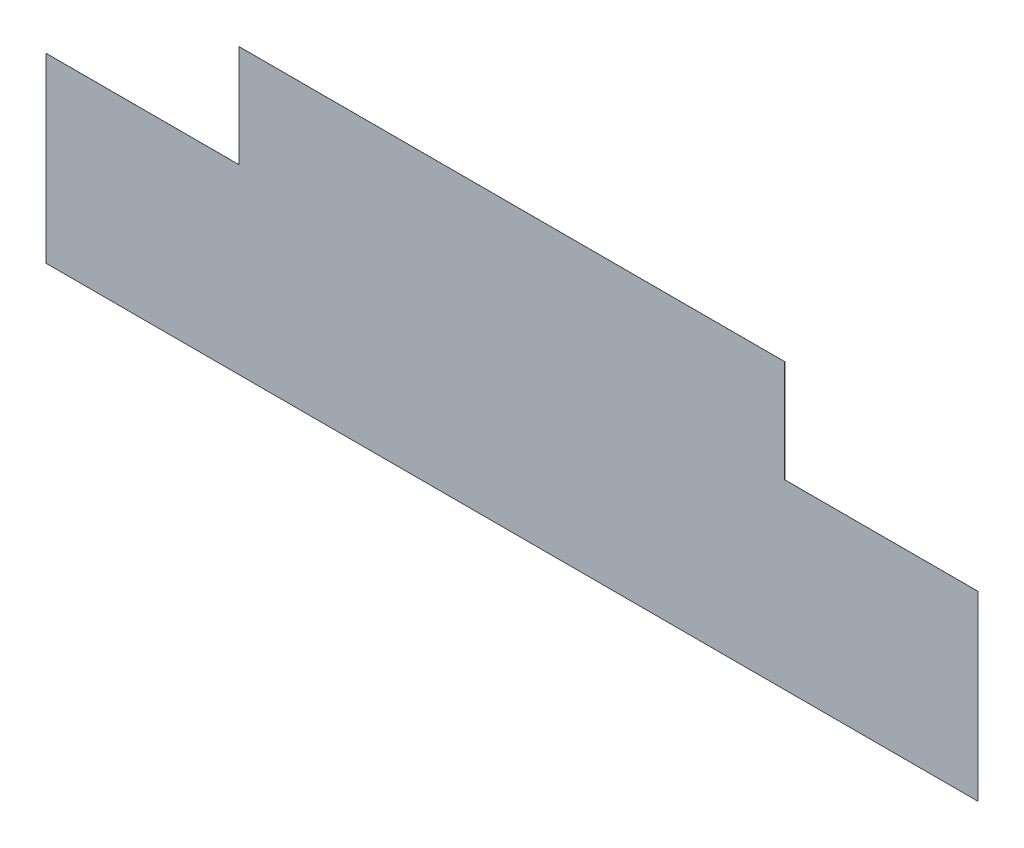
ISO-10303-21;
HEADER;
FILE_DESCRIPTION(('STEP AP214'),'2;1');
FILE_NAME('part.step','',(''),(''),'','','');
FILE_SCHEMA(('AUTOMOTIVE_DESIGN { 1 0 10303 214 1 1 1 1 }'));
ENDSEC;
DATA;
#1=APPLICATION_CONTEXT('core data for automotive mechanical design processes');
#2=APPLICATION_PROTOCOL_DEFINITION('international standard','automotive_design',2000,#1);
#3=PRODUCT_CONTEXT('',#1,'mechanical');
#4=PRODUCT('Part','Part','',(#3));
#5=PRODUCT_RELATED_PRODUCT_CATEGORY('part','',(#4));
#6=PRODUCT_DEFINITION_FORMATION('','',#4);
#7=PRODUCT_DEFINITION_CONTEXT('part definition',#1,'design');
#8=PRODUCT_DEFINITION('design','',#6,#7);
#9=PRODUCT_DEFINITION_SHAPE('','',#8);
#10=(LENGTH_UNIT() NAMED_UNIT(*) SI_UNIT(.MILLI.,.METRE.));
#11=(NAMED_UNIT(*) PLANE_ANGLE_UNIT() SI_UNIT($,.RADIAN.));
#12=(NAMED_UNIT(*) SI_UNIT($,.STERADIAN.) SOLID_ANGLE_UNIT());
#13=UNCERTAINTY_MEASURE_WITH_UNIT(LENGTH_MEASURE(1.E-05),#10,'distance_accuracy_value','');
#14=(GEOMETRIC_REPRESENTATION_CONTEXT(3) GLOBAL_UNCERTAINTY_ASSIGNED_CONTEXT((#13)) GLOBAL_UNIT_ASSIGNED_CONTEXT((#10,
#11,#12)) REPRESENTATION_CONTEXT('',''));
#15=CARTESIAN_POINT('',(0.,0.,0.));
#16=DIRECTION('',(0.,0.,1.));
#17=DIRECTION('',(1.,0.,0.));
#18=AXIS2_PLACEMENT_3D('',#15,#16,#17);
#19=CARTESIAN_POINT('',(0.,0.,0.));
#20=DIRECTION('',(0.,0.,-1.));
#21=DIRECTION('',(0.,-1.,0.));
#22=AXIS2_PLACEMENT_3D('',#19,#20,#21);
#23=PLANE('',#22);
#24=DIRECTION('',(0.,1.,0.));
#25=VECTOR('',#24,1.);
#26=CARTESIAN_POINT('',(-1.2,0.826149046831,0.));
#27=LINE('',#26,#25);
#28=CARTESIAN_POINT('',(-1.2,0.376149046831,0.));
#29=VERTEX_POINT('',#28);
#30=CARTESIAN_POINT('',(-1.2,0.826149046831,0.));
#31=VERTEX_POINT('',#30);
#32=EDGE_CURVE('E117',#29,#31,#27,.T.);
#33=ORIENTED_EDGE('',*,*,#32,.T.);
#34=DIRECTION('',(1.,0.,0.));
#35=VECTOR('',#34,1.);
#36=CARTESIAN_POINT('',(-1.2,0.826149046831,0.));
#37=LINE('',#36,#35);
#38=CARTESIAN_POINT('',(1.2,0.826149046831,0.));
#39=VERTEX_POINT('',#38);
#40=EDGE_CURVE('E130',#31,#39,#37,.T.);
#41=ORIENTED_EDGE('',*,*,#40,.T.);
#42=DIRECTION('',(0.,-1.,0.));
#43=VECTOR('',#42,1.);
#44=CARTESIAN_POINT('',(1.2,0.826149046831,0.));
#45=LINE('',#44,#43);
#46=CARTESIAN_POINT('',(1.2,0.376149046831,0.));
#47=VERTEX_POINT('',#46);
#48=EDGE_CURVE('E198',#39,#47,#45,.T.);
#49=ORIENTED_EDGE('',*,*,#48,.T.);
#50=DIRECTION('',(1.,0.,0.));
#51=VECTOR('',#50,1.);
#52=CARTESIAN_POINT('',(1.2,0.376149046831,0.));
#53=LINE('',#52,#51);
#54=CARTESIAN_POINT('',(2.05,0.376149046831,0.));
#55=VERTEX_POINT('',#54);
#56=EDGE_CURVE('E193',#47,#55,#53,.T.);
#57=ORIENTED_EDGE('',*,*,#56,.T.);
#58=DIRECTION('',(0.,-1.,0.));
#59=VECTOR('',#58,1.);
#60=CARTESIAN_POINT('',(2.05,0.376149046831,0.));
#61=LINE('',#60,#59);
#62=CARTESIAN_POINT('',(2.05,-0.423850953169,0.));
#63=VERTEX_POINT('',#62);
#64=EDGE_CURVE('E175',#55,#63,#61,.T.);
#65=ORIENTED_EDGE('',*,*,#64,.T.);
#66=DIRECTION('',(-1.,0.,0.));
#67=VECTOR('',#66,1.);
#68=CARTESIAN_POINT('',(2.05,-0.423850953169,0.));
#69=LINE('',#68,#67);
#70=CARTESIAN_POINT('',(-2.05,-0.423850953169,0.));
#71=VERTEX_POINT('',#70);
#72=EDGE_CURVE('E134',#63,#71,#69,.T.);
#73=ORIENTED_EDGE('',*,*,#72,.T.);
#74=DIRECTION('',(0.,1.,0.));
#75=VECTOR('',#74,1.);
#76=CARTESIAN_POINT('',(-2.05,-0.423850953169,0.));
#77=LINE('',#76,#75);
#78=CARTESIAN_POINT('',(-2.05,0.376149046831,0.));
#79=VERTEX_POINT('',#78);
#80=EDGE_CURVE('E146',#71,#79,#77,.T.);
#81=ORIENTED_EDGE('',*,*,#80,.T.);
#82=DIRECTION('',(1.,0.,0.));
#83=VECTOR('',#82,1.);
#84=CARTESIAN_POINT('',(-1.2,0.376149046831,0.));
#85=LINE('',#84,#83);
#86=EDGE_CURVE('E25',#79,#29,#85,.T.);
#87=ORIENTED_EDGE('',*,*,#86,.T.);
#88=EDGE_LOOP('',(#33,#41,#49,#57,#65,#73,#81,#87));
#89=FACE_BOUND('',#88,.T.);
#90=ADVANCED_FACE('F17',(#89),#23,.T.);
#91=CARTESIAN_POINT('',(0.,0.,0.0002));
#92=DIRECTION('',(0.,0.,-1.));
#93=DIRECTION('',(0.,-1.,0.));
#94=AXIS2_PLACEMENT_3D('',#91,#92,#93);
#95=PLANE('',#94);
#96=DIRECTION('',(0.,1.,0.));
#97=VECTOR('',#96,1.);
#98=CARTESIAN_POINT('',(-1.2,0.826149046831,0.0002));
#99=LINE('',#98,#97);
#100=CARTESIAN_POINT('',(-1.2,0.376149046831,0.0002));
#101=VERTEX_POINT('',#100);
#102=CARTESIAN_POINT('',(-1.2,0.826149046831,0.0002));
#103=VERTEX_POINT('',#102);
#104=EDGE_CURVE('E105',#101,#103,#99,.T.);
#105=ORIENTED_EDGE('',*,*,#104,.F.);
#106=DIRECTION('',(1.,0.,0.));
#107=VECTOR('',#106,1.);
#108=CARTESIAN_POINT('',(-1.2,0.376149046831,0.0002));
#109=LINE('',#108,#107);
#110=CARTESIAN_POINT('',(-2.05,0.376149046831,0.0002));
#111=VERTEX_POINT('',#110);
#112=EDGE_CURVE('E11',#111,#101,#109,.T.);
#113=ORIENTED_EDGE('',*,*,#112,.F.);
#114=DIRECTION('',(0.,1.,0.));
#115=VECTOR('',#114,1.);
#116=CARTESIAN_POINT('',(-2.05,-0.423850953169,0.0002));
#117=LINE('',#116,#115);
#118=CARTESIAN_POINT('',(-2.05,-0.423850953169,0.0002));
#119=VERTEX_POINT('',#118);
#120=EDGE_CURVE('E150',#119,#111,#117,.T.);
#121=ORIENTED_EDGE('',*,*,#120,.F.);
#122=DIRECTION('',(-1.,0.,0.));
#123=VECTOR('',#122,1.);
#124=CARTESIAN_POINT('',(2.05,-0.423850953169,0.0002));
#125=LINE('',#124,#123);
#126=CARTESIAN_POINT('',(2.05,-0.423850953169,0.0002));
#127=VERTEX_POINT('',#126);
#128=EDGE_CURVE('E138',#127,#119,#125,.T.);
#129=ORIENTED_EDGE('',*,*,#128,.F.);
#130=DIRECTION('',(0.,-1.,0.));
#131=VECTOR('',#130,1.);
#132=CARTESIAN_POINT('',(2.05,0.376149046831,0.0002));
#133=LINE('',#132,#131);
#134=CARTESIAN_POINT('',(2.05,0.376149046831,0.0002));
#135=VERTEX_POINT('',#134);
#136=EDGE_CURVE('E168',#135,#127,#133,.T.);
#137=ORIENTED_EDGE('',*,*,#136,.F.);
#138=DIRECTION('',(1.,0.,0.));
#139=VECTOR('',#138,1.);
#140=CARTESIAN_POINT('',(1.2,0.376149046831,0.0002));
#141=LINE('',#140,#139);
#142=CARTESIAN_POINT('',(1.2,0.376149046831,0.0002));
#143=VERTEX_POINT('',#142);
#144=EDGE_CURVE('E171',#143,#135,#141,.T.);
#145=ORIENTED_EDGE('',*,*,#144,.F.);
#146=DIRECTION('',(0.,-1.,0.));
#147=VECTOR('',#146,1.);
#148=CARTESIAN_POINT('',(1.2,0.826149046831,0.0002));
#149=LINE('',#148,#147);
#150=CARTESIAN_POINT('',(1.2,0.826149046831,0.0002));
#151=VERTEX_POINT('',#150);
#152=EDGE_CURVE('E124',#151,#143,#149,.T.);
#153=ORIENTED_EDGE('',*,*,#152,.F.);
#154=DIRECTION('',(1.,0.,0.));
#155=VECTOR('',#154,1.);
#156=CARTESIAN_POINT('',(-1.2,0.826149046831,0.0002));
#157=LINE('',#156,#155);
#158=EDGE_CURVE('E108',#103,#151,#157,.T.);
#159=ORIENTED_EDGE('',*,*,#158,.F.);
#160=EDGE_LOOP('',(#105,#113,#121,#129,#137,#145,#153,#159));
#161=FACE_BOUND('',#160,.T.);
#162=ADVANCED_FACE('F106',(#161),#95,.F.);
#163=CARTESIAN_POINT('',(-1.2,0.376149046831,0.0002));
#164=DIRECTION('',(0.,1.,0.));
#165=DIRECTION('',(1.,0.,0.));
#166=AXIS2_PLACEMENT_3D('',#163,#164,#165);
#167=PLANE('',#166);
#168=ORIENTED_EDGE('',*,*,#86,.F.);
#169=DIRECTION('',(0.,0.,-1.));
#170=VECTOR('',#169,1.);
#171=CARTESIAN_POINT('',(-2.05,0.376149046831,0.0002));
#172=LINE('',#171,#170);
#173=EDGE_CURVE('E102',#111,#79,#172,.T.);
#174=ORIENTED_EDGE('',*,*,#173,.F.);
#175=ORIENTED_EDGE('',*,*,#112,.T.);
#176=DIRECTION('',(0.,0.,-1.));
#177=VECTOR('',#176,1.);
#178=CARTESIAN_POINT('',(-1.2,0.376149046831,0.0002));
#179=LINE('',#178,#177);
#180=EDGE_CURVE('E100',#101,#29,#179,.T.);
#181=ORIENTED_EDGE('',*,*,#180,.T.);
#182=EDGE_LOOP('',(#168,#174,#175,#181));
#183=FACE_BOUND('',#182,.T.);
#184=ADVANCED_FACE('F98',(#183),#167,.T.);
#185=CARTESIAN_POINT('',(-2.05,-0.423850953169,0.0002));
#186=DIRECTION('',(-1.,0.,0.));
#187=DIRECTION('',(0.,0.,1.));
#188=AXIS2_PLACEMENT_3D('',#185,#186,#187);
#189=PLANE('',#188);
#190=ORIENTED_EDGE('',*,*,#80,.F.);
#191=DIRECTION('',(0.,0.,-1.));
#192=VECTOR('',#191,1.);
#193=CARTESIAN_POINT('',(-2.05,-0.423850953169,0.0002));
#194=LINE('',#193,#192);
#195=EDGE_CURVE('E142',#119,#71,#194,.T.);
#196=ORIENTED_EDGE('',*,*,#195,.F.);
#197=ORIENTED_EDGE('',*,*,#120,.T.);
#198=ORIENTED_EDGE('',*,*,#173,.T.);
#199=EDGE_LOOP('',(#190,#196,#197,#198));
#200=FACE_BOUND('',#199,.T.);
#201=ADVANCED_FACE('F160',(#200),#189,.T.);
#202=CARTESIAN_POINT('',(2.05,-0.423850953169,0.0002));
#203=DIRECTION('',(0.,-1.,0.));
#204=DIRECTION('',(0.,0.,-1.));
#205=AXIS2_PLACEMENT_3D('',#202,#203,#204);
#206=PLANE('',#205);
#207=ORIENTED_EDGE('',*,*,#72,.F.);
#208=DIRECTION('',(0.,0.,-1.));
#209=VECTOR('',#208,1.);
#210=CARTESIAN_POINT('',(2.05,-0.423850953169,0.0002));
#211=LINE('',#210,#209);
#212=EDGE_CURVE('E165',#127,#63,#211,.T.);
#213=ORIENTED_EDGE('',*,*,#212,.F.);
#214=ORIENTED_EDGE('',*,*,#128,.T.);
#215=ORIENTED_EDGE('',*,*,#195,.T.);
#216=EDGE_LOOP('',(#207,#213,#214,#215));
#217=FACE_BOUND('',#216,.T.);
#218=ADVANCED_FACE('F162',(#217),#206,.T.);
#219=CARTESIAN_POINT('',(-1.2,0.826149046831,0.0002));
#220=DIRECTION('',(0.,1.,0.));
#221=DIRECTION('',(1.,0.,0.));
#222=AXIS2_PLACEMENT_3D('',#219,#220,#221);
#223=PLANE('',#222);
#224=ORIENTED_EDGE('',*,*,#40,.F.);
#225=DIRECTION('',(0.,0.,-1.));
#226=VECTOR('',#225,1.);
#227=CARTESIAN_POINT('',(-1.2,0.826149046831,0.0002));
#228=LINE('',#227,#226);
#229=EDGE_CURVE('E113',#103,#31,#228,.T.);
#230=ORIENTED_EDGE('',*,*,#229,.F.);
#231=ORIENTED_EDGE('',*,*,#158,.T.);
#232=DIRECTION('',(0.,0.,-1.));
#233=VECTOR('',#232,1.);
#234=CARTESIAN_POINT('',(1.2,0.826149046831,0.0002));
#235=LINE('',#234,#233);
#236=EDGE_CURVE('E128',#151,#39,#235,.T.);
#237=ORIENTED_EDGE('',*,*,#236,.T.);
#238=EDGE_LOOP('',(#224,#230,#231,#237));
#239=FACE_BOUND('',#238,.T.);
#240=ADVANCED_FACE('F222',(#239),#223,.T.);
#241=CARTESIAN_POINT('',(-1.2,0.826149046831,0.0002));
#242=DIRECTION('',(-1.,0.,0.));
#243=DIRECTION('',(0.,0.,1.));
#244=AXIS2_PLACEMENT_3D('',#241,#242,#243);
#245=PLANE('',#244);
#246=ORIENTED_EDGE('',*,*,#32,.F.);
#247=ORIENTED_EDGE('',*,*,#180,.F.);
#248=ORIENTED_EDGE('',*,*,#104,.T.);
#249=ORIENTED_EDGE('',*,*,#229,.T.);
#250=EDGE_LOOP('',(#246,#247,#248,#249));
#251=FACE_BOUND('',#250,.T.);
#252=ADVANCED_FACE('F115',(#251),#245,.T.);
#253=CARTESIAN_POINT('',(1.2,0.826149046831,0.0002));
#254=DIRECTION('',(1.,0.,0.));
#255=DIRECTION('',(0.,1.,0.));
#256=AXIS2_PLACEMENT_3D('',#253,#254,#255);
#257=PLANE('',#256);
#258=ORIENTED_EDGE('',*,*,#48,.F.);
#259=ORIENTED_EDGE('',*,*,#236,.F.);
#260=ORIENTED_EDGE('',*,*,#152,.T.);
#261=DIRECTION('',(0.,0.,-1.));
#262=VECTOR('',#261,1.);
#263=CARTESIAN_POINT('',(1.2,0.376149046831,0.0002));
#264=LINE('',#263,#262);
#265=EDGE_CURVE('E187',#143,#47,#264,.T.);
#266=ORIENTED_EDGE('',*,*,#265,.T.);
#267=EDGE_LOOP('',(#258,#259,#260,#266));
#268=FACE_BOUND('',#267,.T.);
#269=ADVANCED_FACE('F223',(#268),#257,.T.);
#270=CARTESIAN_POINT('',(2.05,0.376149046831,0.0002));
#271=DIRECTION('',(1.,0.,0.));
#272=DIRECTION('',(0.,1.,0.));
#273=AXIS2_PLACEMENT_3D('',#270,#271,#272);
#274=PLANE('',#273);
#275=ORIENTED_EDGE('',*,*,#64,.F.);
#276=DIRECTION('',(0.,0.,-1.));
#277=VECTOR('',#276,1.);
#278=CARTESIAN_POINT('',(2.05,0.376149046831,0.0002));
#279=LINE('',#278,#277);
#280=EDGE_CURVE('E178',#135,#55,#279,.T.);
#281=ORIENTED_EDGE('',*,*,#280,.F.);
#282=ORIENTED_EDGE('',*,*,#136,.T.);
#283=ORIENTED_EDGE('',*,*,#212,.T.);
#284=EDGE_LOOP('',(#275,#281,#282,#283));
#285=FACE_BOUND('',#284,.T.);
#286=ADVANCED_FACE('F179',(#285),#274,.T.);
#287=CARTESIAN_POINT('',(1.2,0.376149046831,0.0002));
#288=DIRECTION('',(0.,1.,0.));
#289=DIRECTION('',(1.,0.,0.));
#290=AXIS2_PLACEMENT_3D('',#287,#288,#289);
#291=PLANE('',#290);
#292=ORIENTED_EDGE('',*,*,#56,.F.);
#293=ORIENTED_EDGE('',*,*,#265,.F.);
#294=ORIENTED_EDGE('',*,*,#144,.T.);
#295=ORIENTED_EDGE('',*,*,#280,.T.);
#296=EDGE_LOOP('',(#292,#293,#294,#295));
#297=FACE_BOUND('',#296,.T.);
#298=ADVANCED_FACE('F185',(#297),#291,.T.);
#299=CLOSED_SHELL('',(#90,#162,#184,#201,#218,#240,#252,#269,#286,#298));
#300=MANIFOLD_SOLID_BREP('B1',#299);
#301=ADVANCED_BREP_SHAPE_REPRESENTATION('',(#18,#300),#14);
#302=SHAPE_DEFINITION_REPRESENTATION(#9,#301);
ENDSEC;
END-ISO-10303-21;
